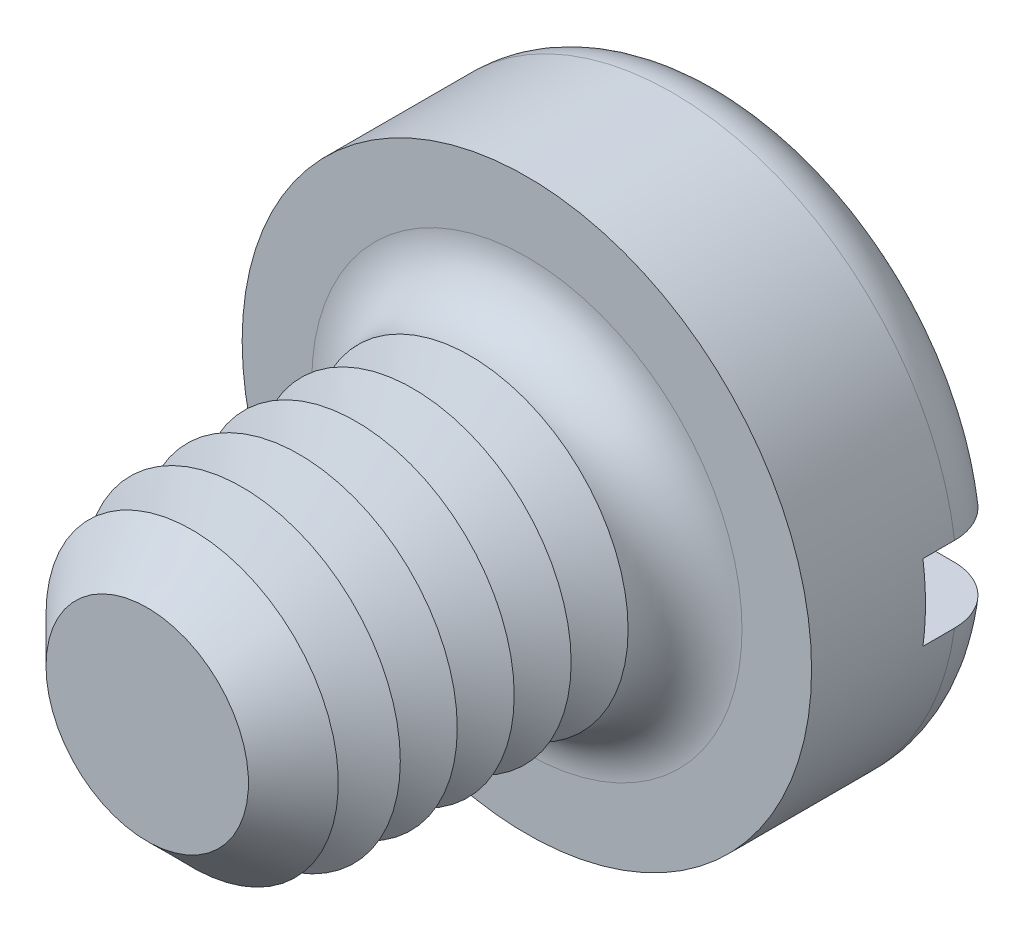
from build123d import *

# Parameters (mm, degrees)
SKETCH3_R           = 2.25
BOSS_EXTRUDE2_DEPTH = 1.6
SKETCH4_R           = 1.25
BOSS_EXTRUDE3_DEPTH = 3
FILLET1_R           = 0.45
CHAMFER1_SIZE       = 0.45
LPATTERN1_COUNT     = 5
LPATTERN1_PITCH     = 0.45
SKETCH8_W           = 4.5
SKETCH8_H           = 0.6
CUT_EXTRUDE1_DEPTH  = 0.7


with BuildPart() as part:
    # Sketch3 → Boss-Extrude2 (new body)
    with BuildSketch(Plane.XY):
        Circle(SKETCH3_R)
    extrude(amount=-BOSS_EXTRUDE2_DEPTH)

    # Sketch4 → Boss-Extrude3 (add)
    with BuildSketch(Plane.XY):
        Circle(SKETCH4_R)
    extrude(amount=BOSS_EXTRUDE3_DEPTH)

    # Fillet1
    fillet1_edges = [part.edges().sort_by_distance(p)[0] for p in [
        (-2.25, 0, -1.6),
        (-1.25, 0, 0),
    ]]
    fillet(fillet1_edges, radius=FILLET1_R)

    # Chamfer1
    chamfer1_edges = [part.edges().sort_by_distance(p)[0] for p in [
        (-1.25, 0, 3),
    ]]
    chamfer(chamfer1_edges, length=CHAMFER1_SIZE)

    # Sketch6 → Cut-Revolve1 (revolve, cut)
    with BuildSketch(Plane(origin=(0, 0, 0), x_dir=(0, 0, -1), z_dir=(1, 0, 0)), mode=Mode.PRIVATE) as cut_revolve1_sk:
        Polygon((-0.45, 1.25), (-0.675, 0.860288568), (-0.9, 1.25), align=None)
    cut_revolve1 = revolve(cut_revolve1_sk.sketch.rotate(Axis((0, 0, -1.694361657), (0, 0, 1)), 90), axis=Axis((0, 0, -1.694361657), (0, 0, 1)), mode=Mode.SUBTRACT)

    # LPattern1: Cut-Revolve1 ×5
    with Locations(*[(0, 0, i * LPATTERN1_PITCH) for i in range(1, LPATTERN1_COUNT)]):
        add(cut_revolve1, mode=Mode.SUBTRACT)

    # Sketch8 → Cut-Extrude1 (cut)
    with BuildSketch(Plane(origin=(0, 0, -1.6), x_dir=(-1, 0, 0), z_dir=(0, 0, -1))):
        Rectangle(SKETCH8_W, SKETCH8_H)
    extrude(amount=-CUT_EXTRUDE1_DEPTH, mode=Mode.SUBTRACT)


solid = part.part
